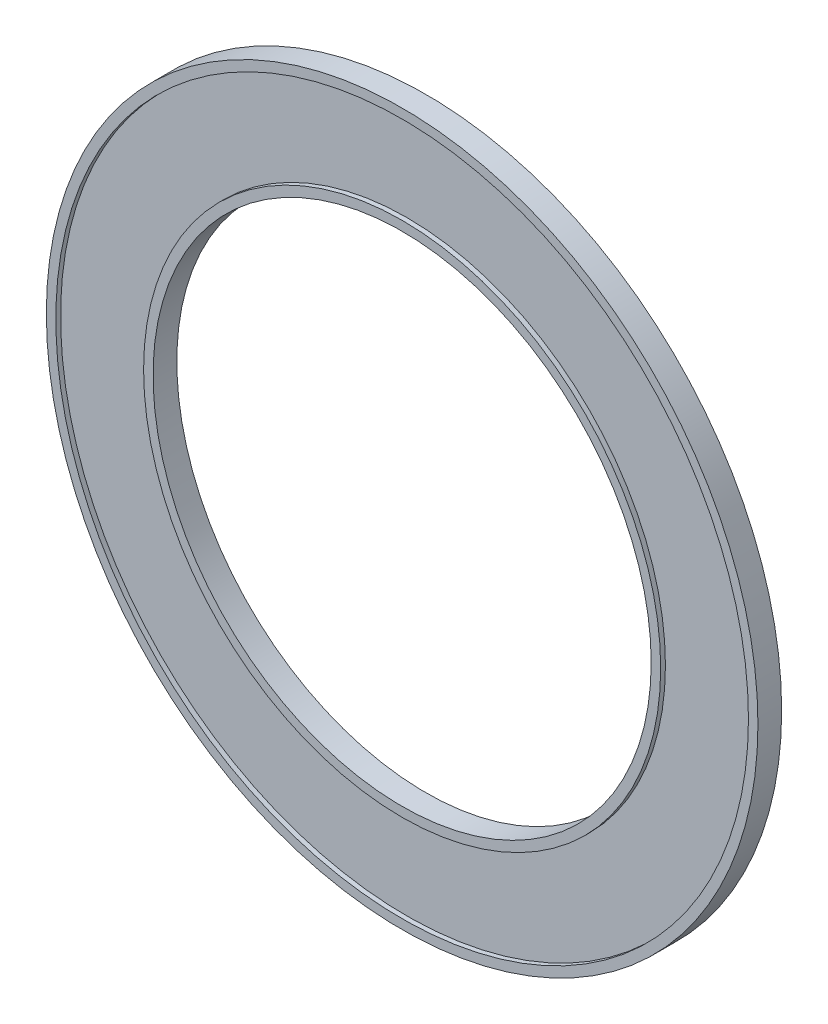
from build123d import *

# Parameters (mm, degrees)
SKETCH1_R           = 150
SKETCH1_R_2         = 105
BOSS_EXTRUDE1_DEPTH = 10
SKETCH2_R           = 146
SKETCH2_R_2         = 109
CUT_EXTRUDE1_DEPTH  = 2
SKETCH3_R           = 5
CUT_EXTRUDE2_DEPTH  = 6


with BuildPart() as part:
    # Sketch1 → Boss-Extrude1 (new body)
    with BuildSketch(Plane.XY):
        Circle(SKETCH1_R)
        Circle(SKETCH1_R_2, mode=Mode.SUBTRACT)
    extrude(amount=BOSS_EXTRUDE1_DEPTH)

    # Sketch2 → Cut-Extrude1 (cut)
    with BuildSketch(Plane.XY.offset(10)):
        Circle(SKETCH2_R)
        Circle(SKETCH2_R_2, mode=Mode.SUBTRACT)
    extrude(amount=-CUT_EXTRUDE1_DEPTH, mode=Mode.SUBTRACT)

    # Sketch3 → Cut-Extrude2 (cut)
    with BuildSketch(Plane(origin=(0, 0, 0), x_dir=(-1, 0, 0), z_dir=(0, 0, -1))):
        with Locations((0, 126)):
            Circle(SKETCH3_R)
        with Locations((0, -126)):
            Circle(SKETCH3_R)
    extrude(amount=-CUT_EXTRUDE2_DEPTH, mode=Mode.SUBTRACT)


solid = part.part
